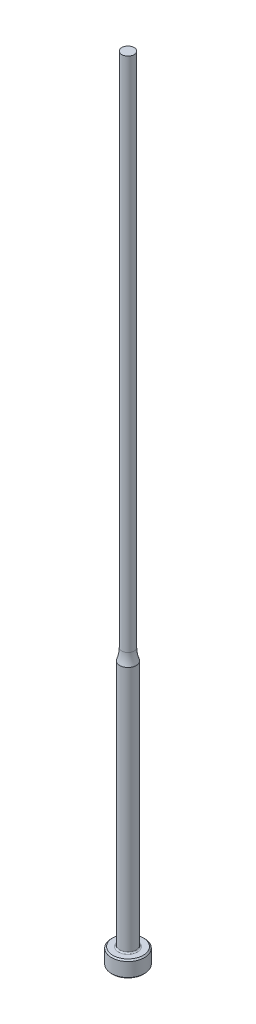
from build123d import *

# Parameters (mm, degrees)
CHAMFER1_SIZE = 0.254
FILLET1_R     = 0.254


with BuildPart() as part:
    # Sketch1 → Revolve1 (revolve)
    with BuildSketch(Plane.XY, mode=Mode.PRIVATE) as revolve1_sk:
        with BuildLine():
            Line((0, 0), (-3.175, 0))
            Line((-3.175, 0), (-3.175, 3.175))
            Line((-3.175, 3.175), (-1.5875, 3.175))
            Line((-1.5875, 3.175), (-1.5875, 50.8))
            ThreePointArc((-1.5875, 50.8), (-1.290157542, 51.887986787), (-1.18999, 53.011416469))
            Line((-1.18999, 53.011416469), (-1.18999, 152.4))
            Line((-1.18999, 152.4), (0, 152.4))
            Line((0, 152.4), (0, 0))
        make_face()
    revolve(revolve1_sk.sketch.rotate(Axis((0, 259.958771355, 0), (0, -1, 0)), 270), axis=Axis((0, 259.958771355, 0), (0, -1, 0)))

    # Chamfer1
    chamfer1_edges = [part.edges().sort_by_distance(p)[0] for p in [
        (0, 0, -3.175),
        (0, 3.175, -3.175),
    ]]
    chamfer(chamfer1_edges, length=CHAMFER1_SIZE)

    # Fillet1
    fillet1_edges = [part.edges().sort_by_distance(p)[0] for p in [
        (0, 3.175, -1.5875),
    ]]
    fillet(fillet1_edges, radius=FILLET1_R)


solid = part.part
